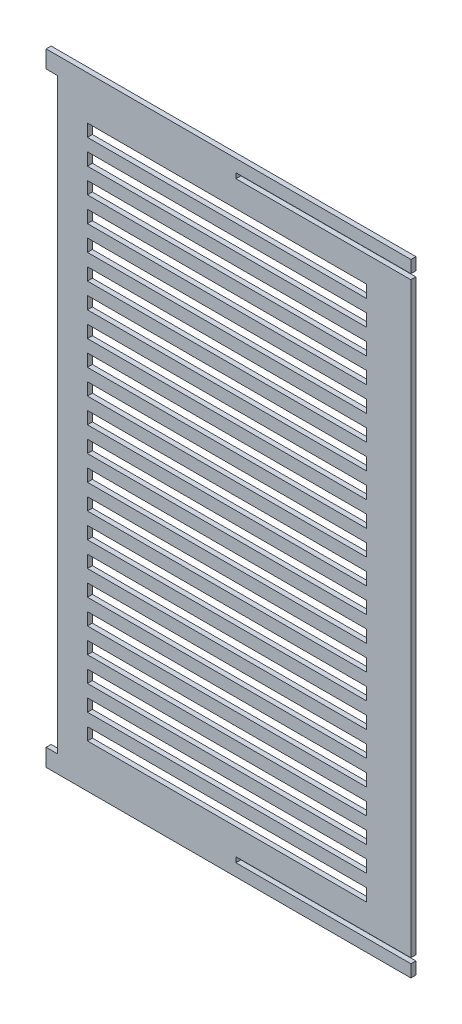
from build123d import *

# Parameters (mm, degrees)
MODEL_W         = 224.3731
MODEL_H         = 10
EXTRUDE_1_DEPTH = 4


with BuildPart() as part:
    # Model → Extrude 1 (new body)
    with BuildSketch(Plane.XY):
        Polygon((-1807.5625, -460.5475), (-1807.5625, -464.5475), (-1807.5625, -464.6476), (-1666.9398, -464.6476), (-1666.9398, -936.4475), (-1807.5625, -936.4475), (-1807.5625, -936.5475), (-1807.5625, -940.5475), (-1807.5625, -940.6475), (-1666.9398, -940.6475), (-1666.9398, -950.5475), (-1960.0441, -950.5475), (-1960.0441, -936.5475), (-1950.9398, -936.5475), (-1950.9398, -464.5475), (-1960.0441, -464.5475), (-1960.0441, -450.5475), (-1666.9398, -450.5475), (-1666.9398, -460.4476), (-1807.5625, -460.4476), align=None)
        with Locations((-1814.69445, -910.5475)):
            Rectangle(MODEL_W, MODEL_H, mode=Mode.SUBTRACT)
        with Locations((-1814.69445, -890.5475)):
            Rectangle(MODEL_W, MODEL_H, mode=Mode.SUBTRACT)
        with Locations((-1814.69445, -870.5475)):
            Rectangle(MODEL_W, MODEL_H, mode=Mode.SUBTRACT)
        with Locations((-1814.69445, -850.5475)):
            Rectangle(MODEL_W, MODEL_H, mode=Mode.SUBTRACT)
        with Locations((-1814.69445, -830.5475)):
            Rectangle(MODEL_W, MODEL_H, mode=Mode.SUBTRACT)
        with Locations((-1814.69445, -810.5475)):
            Rectangle(MODEL_W, MODEL_H, mode=Mode.SUBTRACT)
        with Locations((-1814.69445, -790.5475)):
            Rectangle(MODEL_W, MODEL_H, mode=Mode.SUBTRACT)
        with Locations((-1814.69445, -770.5475)):
            Rectangle(MODEL_W, MODEL_H, mode=Mode.SUBTRACT)
        with Locations((-1814.69445, -750.5475)):
            Rectangle(MODEL_W, MODEL_H, mode=Mode.SUBTRACT)
        with Locations((-1814.69445, -730.5475)):
            Rectangle(MODEL_W, MODEL_H, mode=Mode.SUBTRACT)
        with Locations((-1814.69445, -710.5475)):
            Rectangle(MODEL_W, MODEL_H, mode=Mode.SUBTRACT)
        with Locations((-1814.69445, -690.5475)):
            Rectangle(MODEL_W, MODEL_H, mode=Mode.SUBTRACT)
        with Locations((-1814.69445, -670.5475)):
            Rectangle(MODEL_W, MODEL_H, mode=Mode.SUBTRACT)
        with Locations((-1814.69445, -650.5475)):
            Rectangle(MODEL_W, MODEL_H, mode=Mode.SUBTRACT)
        with Locations((-1814.69445, -630.5475)):
            Rectangle(MODEL_W, MODEL_H, mode=Mode.SUBTRACT)
        with Locations((-1814.69445, -610.5475)):
            Rectangle(MODEL_W, MODEL_H, mode=Mode.SUBTRACT)
        with Locations((-1814.69445, -590.5475)):
            Rectangle(MODEL_W, MODEL_H, mode=Mode.SUBTRACT)
        with Locations((-1814.69445, -570.5475)):
            Rectangle(MODEL_W, MODEL_H, mode=Mode.SUBTRACT)
        with Locations((-1814.69445, -550.5475)):
            Rectangle(MODEL_W, MODEL_H, mode=Mode.SUBTRACT)
        with Locations((-1814.69445, -530.5475)):
            Rectangle(MODEL_W, MODEL_H, mode=Mode.SUBTRACT)
        with Locations((-1814.69445, -510.5475)):
            Rectangle(MODEL_W, MODEL_H, mode=Mode.SUBTRACT)
        with Locations((-1814.69445, -490.5475)):
            Rectangle(MODEL_W, MODEL_H, mode=Mode.SUBTRACT)
    extrude(amount=EXTRUDE_1_DEPTH)


solid = part.part
